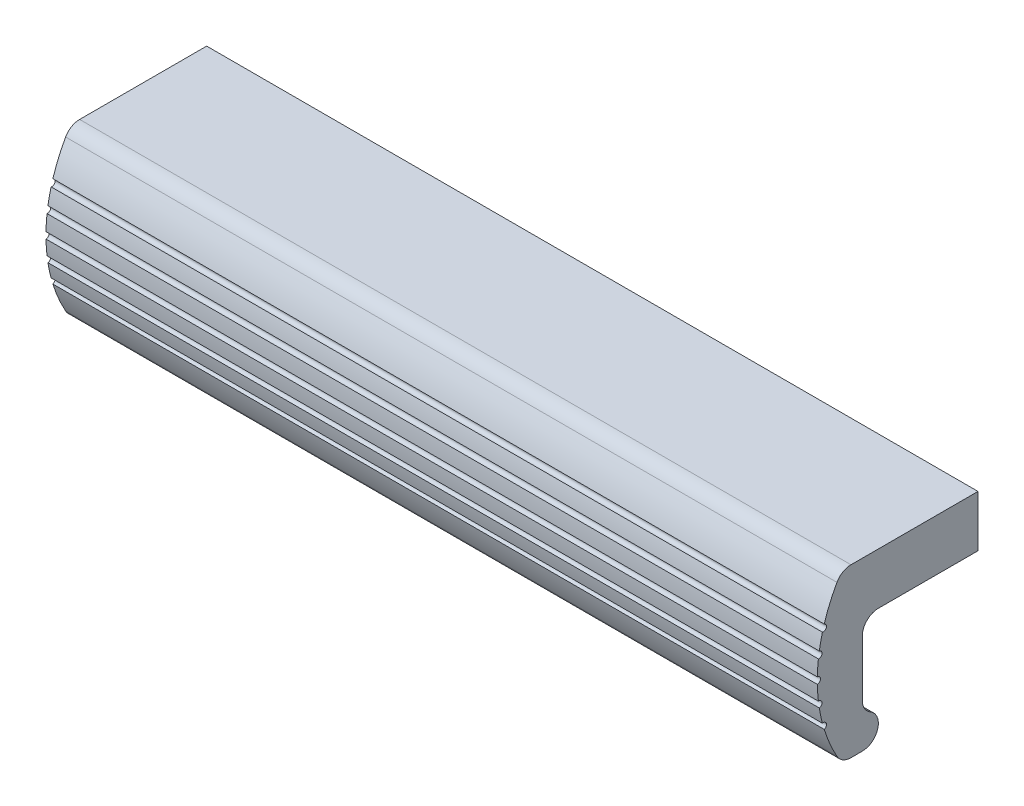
ISO-10303-21;
HEADER;
FILE_DESCRIPTION(('STEP AP214'),'2;1');
FILE_NAME('part.step','',(''),(''),'','','');
FILE_SCHEMA(('AUTOMOTIVE_DESIGN { 1 0 10303 214 1 1 1 1 }'));
ENDSEC;
DATA;
#1=APPLICATION_CONTEXT('core data for automotive mechanical design processes');
#2=APPLICATION_PROTOCOL_DEFINITION('international standard','automotive_design',2000,#1);
#3=PRODUCT_CONTEXT('',#1,'mechanical');
#4=PRODUCT('Part','Part','',(#3));
#5=PRODUCT_RELATED_PRODUCT_CATEGORY('part','',(#4));
#6=PRODUCT_DEFINITION_FORMATION('','',#4);
#7=PRODUCT_DEFINITION_CONTEXT('part definition',#1,'design');
#8=PRODUCT_DEFINITION('design','',#6,#7);
#9=PRODUCT_DEFINITION_SHAPE('','',#8);
#10=(LENGTH_UNIT() NAMED_UNIT(*) SI_UNIT(.MILLI.,.METRE.));
#11=(NAMED_UNIT(*) PLANE_ANGLE_UNIT() SI_UNIT($,.RADIAN.));
#12=(NAMED_UNIT(*) SI_UNIT($,.STERADIAN.) SOLID_ANGLE_UNIT());
#13=UNCERTAINTY_MEASURE_WITH_UNIT(LENGTH_MEASURE(1.E-05),#10,'distance_accuracy_value','');
#14=(GEOMETRIC_REPRESENTATION_CONTEXT(3) GLOBAL_UNCERTAINTY_ASSIGNED_CONTEXT((#13)) GLOBAL_UNIT_ASSIGNED_CONTEXT((#10,
#11,#12)) REPRESENTATION_CONTEXT('',''));
#15=CARTESIAN_POINT('',(0.,0.,0.));
#16=DIRECTION('',(0.,0.,1.));
#17=DIRECTION('',(1.,0.,0.));
#18=AXIS2_PLACEMENT_3D('',#15,#16,#17);
#19=CARTESIAN_POINT('',(-7.5,-4.,0.));
#20=DIRECTION('',(0.,1.,0.));
#21=DIRECTION('',(-1.,0.,0.));
#22=AXIS2_PLACEMENT_3D('',#19,#20,#21);
#23=PLANE('',#22);
#24=DIRECTION('',(1.,0.,0.));
#25=VECTOR('',#24,1.);
#26=CARTESIAN_POINT('',(-7.5,-4.,15.5));
#27=LINE('',#26,#25);
#28=CARTESIAN_POINT('',(-7.5,-4.,15.5));
#29=VERTEX_POINT('',#28);
#30=CARTESIAN_POINT('',(112.5,-4.,15.5));
#31=VERTEX_POINT('',#30);
#32=EDGE_CURVE('E9',#29,#31,#27,.T.);
#33=ORIENTED_EDGE('',*,*,#32,.F.);
#34=DIRECTION('',(0.,0.,1.));
#35=VECTOR('',#34,1.);
#36=CARTESIAN_POINT('',(-7.5,-4.,0.));
#37=LINE('',#36,#35);
#38=CARTESIAN_POINT('',(-7.5,-4.,0.));
#39=VERTEX_POINT('',#38);
#40=EDGE_CURVE('E232',#39,#29,#37,.T.);
#41=ORIENTED_EDGE('',*,*,#40,.F.);
#42=DIRECTION('',(1.,0.,0.));
#43=VECTOR('',#42,1.);
#44=CARTESIAN_POINT('',(-7.5,-4.,0.));
#45=LINE('',#44,#43);
#46=CARTESIAN_POINT('',(112.5,-4.,0.));
#47=VERTEX_POINT('',#46);
#48=EDGE_CURVE('E29',#39,#47,#45,.T.);
#49=ORIENTED_EDGE('',*,*,#48,.T.);
#50=DIRECTION('',(0.,0.,1.));
#51=VECTOR('',#50,1.);
#52=CARTESIAN_POINT('',(112.5,-4.,0.));
#53=LINE('',#52,#51);
#54=EDGE_CURVE('E167',#47,#31,#53,.T.);
#55=ORIENTED_EDGE('',*,*,#54,.T.);
#56=EDGE_LOOP('',(#33,#41,#49,#55));
#57=FACE_BOUND('',#56,.T.);
#58=ADVANCED_FACE('F14',(#57),#23,.F.);
#59=CARTESIAN_POINT('',(-7.5,-6.5,15.5));
#60=DIRECTION('',(1.,0.,0.));
#61=DIRECTION('',(0.,0.,-1.));
#62=AXIS2_PLACEMENT_3D('',#59,#60,#61);
#63=CYLINDRICAL_SURFACE('',#62,2.5);
#64=DIRECTION('',(1.,0.,0.));
#65=VECTOR('',#64,1.);
#66=CARTESIAN_POINT('',(-7.5,-6.5,18.));
#67=LINE('',#66,#65);
#68=CARTESIAN_POINT('',(-7.5,-6.5,18.));
#69=VERTEX_POINT('',#68);
#70=CARTESIAN_POINT('',(112.5,-6.5,18.));
#71=VERTEX_POINT('',#70);
#72=EDGE_CURVE('E22',#69,#71,#67,.T.);
#73=ORIENTED_EDGE('',*,*,#72,.F.);
#74=CARTESIAN_POINT('',(-7.5,-6.5,15.5));
#75=DIRECTION('',(-1.,0.,0.));
#76=DIRECTION('',(0.,0.,1.));
#77=AXIS2_PLACEMENT_3D('',#74,#75,#76);
#78=CIRCLE('',#77,2.5);
#79=EDGE_CURVE('E163',#69,#29,#78,.T.);
#80=ORIENTED_EDGE('',*,*,#79,.T.);
#81=ORIENTED_EDGE('',*,*,#32,.T.);
#82=CARTESIAN_POINT('',(112.5,-6.5,15.5));
#83=DIRECTION('',(-1.,0.,0.));
#84=DIRECTION('',(0.,0.,1.));
#85=AXIS2_PLACEMENT_3D('',#82,#83,#84);
#86=CIRCLE('',#85,2.5);
#87=EDGE_CURVE('E160',#71,#31,#86,.T.);
#88=ORIENTED_EDGE('',*,*,#87,.F.);
#89=EDGE_LOOP('',(#73,#80,#81,#88));
#90=FACE_BOUND('',#89,.T.);
#91=ADVANCED_FACE('F16',(#90),#63,.F.);
#92=CARTESIAN_POINT('',(-7.5,-6.5,18.));
#93=DIRECTION('',(0.,0.,1.));
#94=DIRECTION('',(1.,0.,0.));
#95=AXIS2_PLACEMENT_3D('',#92,#93,#94);
#96=PLANE('',#95);
#97=DIRECTION('',(1.,0.,0.));
#98=VECTOR('',#97,1.);
#99=CARTESIAN_POINT('',(-7.5,-15.1698729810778,18.));
#100=LINE('',#99,#98);
#101=CARTESIAN_POINT('',(-7.5,-15.1698729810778,18.));
#102=VERTEX_POINT('',#101);
#103=CARTESIAN_POINT('',(112.5,-15.1698729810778,18.));
#104=VERTEX_POINT('',#103);
#105=EDGE_CURVE('E324',#102,#104,#100,.T.);
#106=ORIENTED_EDGE('',*,*,#105,.F.);
#107=DIRECTION('',(0.,-1.,0.));
#108=VECTOR('',#107,1.);
#109=CARTESIAN_POINT('',(-7.5,-6.5,18.));
#110=LINE('',#109,#108);
#111=EDGE_CURVE('E235',#69,#102,#110,.T.);
#112=ORIENTED_EDGE('',*,*,#111,.F.);
#113=ORIENTED_EDGE('',*,*,#72,.T.);
#114=DIRECTION('',(0.,-1.,0.));
#115=VECTOR('',#114,1.);
#116=CARTESIAN_POINT('',(112.5,-6.5,18.));
#117=LINE('',#116,#115);
#118=EDGE_CURVE('E175',#71,#104,#117,.T.);
#119=ORIENTED_EDGE('',*,*,#118,.T.);
#120=EDGE_LOOP('',(#106,#112,#113,#119));
#121=FACE_BOUND('',#120,.T.);
#122=ADVANCED_FACE('F327',(#121),#96,.F.);
#123=CARTESIAN_POINT('',(-7.5,-15.1698729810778,15.5));
#124=DIRECTION('',(1.,0.,0.));
#125=DIRECTION('',(0.,0.,-1.));
#126=AXIS2_PLACEMENT_3D('',#123,#124,#125);
#127=CYLINDRICAL_SURFACE('',#126,2.5);
#128=DIRECTION('',(1.,0.,0.));
#129=VECTOR('',#128,1.);
#130=CARTESIAN_POINT('',(-7.5,-17.334936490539,16.75));
#131=LINE('',#130,#129);
#132=CARTESIAN_POINT('',(-7.5,-17.334936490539,16.75));
#133=VERTEX_POINT('',#132);
#134=CARTESIAN_POINT('',(112.5,-17.334936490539,16.75));
#135=VERTEX_POINT('',#134);
#136=EDGE_CURVE('E322',#133,#135,#131,.T.);
#137=ORIENTED_EDGE('',*,*,#136,.F.);
#138=CARTESIAN_POINT('',(-7.5,-15.1698729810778,15.5));
#139=DIRECTION('',(-1.,0.,0.));
#140=DIRECTION('',(0.,0.,1.));
#141=AXIS2_PLACEMENT_3D('',#138,#139,#140);
#142=CIRCLE('',#141,2.5);
#143=EDGE_CURVE('E238',#133,#102,#142,.T.);
#144=ORIENTED_EDGE('',*,*,#143,.T.);
#145=ORIENTED_EDGE('',*,*,#105,.T.);
#146=CARTESIAN_POINT('',(112.5,-15.1698729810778,15.5));
#147=DIRECTION('',(-1.,0.,0.));
#148=DIRECTION('',(0.,0.,1.));
#149=AXIS2_PLACEMENT_3D('',#146,#147,#148);
#150=CIRCLE('',#149,2.5);
#151=EDGE_CURVE('E177',#135,#104,#150,.T.);
#152=ORIENTED_EDGE('',*,*,#151,.F.);
#153=EDGE_LOOP('',(#137,#144,#145,#152));
#154=FACE_BOUND('',#153,.T.);
#155=ADVANCED_FACE('F396',(#154),#127,.F.);
#156=CARTESIAN_POINT('',(-7.5,-19.5,18.));
#157=DIRECTION('',(1.,0.,0.));
#158=DIRECTION('',(0.,0.,-1.));
#159=AXIS2_PLACEMENT_3D('',#156,#157,#158);
#160=CYLINDRICAL_SURFACE('',#159,2.5);
#161=DIRECTION('',(1.,0.,0.));
#162=VECTOR('',#161,1.);
#163=CARTESIAN_POINT('',(-7.5,-22.,18.));
#164=LINE('',#163,#162);
#165=CARTESIAN_POINT('',(-7.5,-22.,18.));
#166=VERTEX_POINT('',#165);
#167=CARTESIAN_POINT('',(112.5,-22.,18.));
#168=VERTEX_POINT('',#167);
#169=EDGE_CURVE('E320',#166,#168,#164,.T.);
#170=ORIENTED_EDGE('',*,*,#169,.F.);
#171=CARTESIAN_POINT('',(-7.5,-19.5,18.));
#172=DIRECTION('',(-1.,0.,0.));
#173=DIRECTION('',(0.,0.,1.));
#174=AXIS2_PLACEMENT_3D('',#171,#172,#173);
#175=CIRCLE('',#174,2.5);
#176=EDGE_CURVE('E241',#133,#166,#175,.T.);
#177=ORIENTED_EDGE('',*,*,#176,.F.);
#178=ORIENTED_EDGE('',*,*,#136,.T.);
#179=CARTESIAN_POINT('',(112.5,-19.5,18.));
#180=DIRECTION('',(-1.,0.,0.));
#181=DIRECTION('',(0.,0.,1.));
#182=AXIS2_PLACEMENT_3D('',#179,#180,#181);
#183=CIRCLE('',#182,2.5);
#184=EDGE_CURVE('E182',#135,#168,#183,.T.);
#185=ORIENTED_EDGE('',*,*,#184,.T.);
#186=EDGE_LOOP('',(#170,#177,#178,#185));
#187=FACE_BOUND('',#186,.T.);
#188=ADVANCED_FACE('F393',(#187),#160,.T.);
#189=CARTESIAN_POINT('',(-7.5,-22.,18.));
#190=DIRECTION('',(0.,1.,0.));
#191=DIRECTION('',(-1.,0.,0.));
#192=AXIS2_PLACEMENT_3D('',#189,#190,#191);
#193=PLANE('',#192);
#194=DIRECTION('',(1.,0.,0.));
#195=VECTOR('',#194,1.);
#196=CARTESIAN_POINT('',(-7.5,-22.,19.7616630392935));
#197=LINE('',#196,#195);
#198=CARTESIAN_POINT('',(-7.5,-22.,19.7616630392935));
#199=VERTEX_POINT('',#198);
#200=CARTESIAN_POINT('',(112.5,-22.,19.7616630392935));
#201=VERTEX_POINT('',#200);
#202=EDGE_CURVE('E318',#199,#201,#197,.T.);
#203=ORIENTED_EDGE('',*,*,#202,.F.);
#204=DIRECTION('',(0.,0.,1.));
#205=VECTOR('',#204,1.);
#206=CARTESIAN_POINT('',(-7.5,-22.,18.));
#207=LINE('',#206,#205);
#208=EDGE_CURVE('E244',#166,#199,#207,.T.);
#209=ORIENTED_EDGE('',*,*,#208,.F.);
#210=ORIENTED_EDGE('',*,*,#169,.T.);
#211=DIRECTION('',(0.,0.,1.));
#212=VECTOR('',#211,1.);
#213=CARTESIAN_POINT('',(112.5,-22.,18.));
#214=LINE('',#213,#212);
#215=EDGE_CURVE('E185',#168,#201,#214,.T.);
#216=ORIENTED_EDGE('',*,*,#215,.T.);
#217=EDGE_LOOP('',(#203,#209,#210,#216));
#218=FACE_BOUND('',#217,.T.);
#219=ADVANCED_FACE('F390',(#218),#193,.F.);
#220=CARTESIAN_POINT('',(-7.5,-19.5,19.7616630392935));
#221=DIRECTION('',(1.,0.,0.));
#222=DIRECTION('',(0.,0.,-1.));
#223=AXIS2_PLACEMENT_3D('',#220,#221,#222);
#224=CYLINDRICAL_SURFACE('',#223,2.5);
#225=DIRECTION('',(1.,0.,0.));
#226=VECTOR('',#225,1.);
#227=CARTESIAN_POINT('',(-7.5,-20.720930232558,21.943251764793));
#228=LINE('',#227,#226);
#229=CARTESIAN_POINT('',(-7.5,-20.720930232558,21.943251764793));
#230=VERTEX_POINT('',#229);
#231=CARTESIAN_POINT('',(112.5,-20.720930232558,21.943251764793));
#232=VERTEX_POINT('',#231);
#233=EDGE_CURVE('E316',#230,#232,#228,.T.);
#234=ORIENTED_EDGE('',*,*,#233,.F.);
#235=CARTESIAN_POINT('',(-7.5,-19.5,19.7616630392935));
#236=DIRECTION('',(-1.,0.,0.));
#237=DIRECTION('',(0.,0.,1.));
#238=AXIS2_PLACEMENT_3D('',#235,#236,#237);
#239=CIRCLE('',#238,2.5);
#240=EDGE_CURVE('E247',#199,#230,#239,.T.);
#241=ORIENTED_EDGE('',*,*,#240,.F.);
#242=ORIENTED_EDGE('',*,*,#202,.T.);
#243=CARTESIAN_POINT('',(112.5,-19.5,19.7616630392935));
#244=DIRECTION('',(-1.,0.,0.));
#245=DIRECTION('',(0.,0.,1.));
#246=AXIS2_PLACEMENT_3D('',#243,#244,#245);
#247=CIRCLE('',#246,2.5);
#248=EDGE_CURVE('E188',#201,#232,#247,.T.);
#249=ORIENTED_EDGE('',*,*,#248,.T.);
#250=EDGE_LOOP('',(#234,#241,#242,#249));
#251=FACE_BOUND('',#250,.T.);
#252=ADVANCED_FACE('F386',(#251),#224,.T.);
#253=CARTESIAN_POINT('',(-7.5,-9.,1.));
#254=DIRECTION('',(1.,0.,0.));
#255=DIRECTION('',(0.,0.,-1.));
#256=AXIS2_PLACEMENT_3D('',#253,#254,#255);
#257=CYLINDRICAL_SURFACE('',#256,24.);
#258=DIRECTION('',(1.,0.,0.));
#259=VECTOR('',#258,1.);
#260=CARTESIAN_POINT('',(-7.5,-16.094465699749,23.9274629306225));
#261=LINE('',#260,#259);
#262=CARTESIAN_POINT('',(-7.5,-16.094465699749,23.9274629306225));
#263=VERTEX_POINT('',#262);
#264=CARTESIAN_POINT('',(112.5,-16.094465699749,23.9274629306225));
#265=VERTEX_POINT('',#264);
#266=EDGE_CURVE('E314',#263,#265,#261,.T.);
#267=ORIENTED_EDGE('',*,*,#266,.F.);
#268=CARTESIAN_POINT('',(-7.5,-9.,1.));
#269=DIRECTION('',(-1.,0.,0.));
#270=DIRECTION('',(0.,0.,1.));
#271=AXIS2_PLACEMENT_3D('',#268,#269,#270);
#272=CIRCLE('',#271,24.);
#273=EDGE_CURVE('E250',#230,#263,#272,.T.);
#274=ORIENTED_EDGE('',*,*,#273,.F.);
#275=ORIENTED_EDGE('',*,*,#233,.T.);
#276=CARTESIAN_POINT('',(112.5,-9.,1.));
#277=DIRECTION('',(-1.,0.,0.));
#278=DIRECTION('',(0.,0.,1.));
#279=AXIS2_PLACEMENT_3D('',#276,#277,#278);
#280=CIRCLE('',#279,24.);
#281=EDGE_CURVE('E191',#232,#265,#280,.T.);
#282=ORIENTED_EDGE('',*,*,#281,.T.);
#283=EDGE_LOOP('',(#267,#274,#275,#282));
#284=FACE_BOUND('',#283,.T.);
#285=ADVANCED_FACE('F381',(#284),#257,.T.);
#286=CARTESIAN_POINT('',(-7.5,-15.615296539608,24.0702807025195));
#287=DIRECTION('',(1.,0.,0.));
#288=DIRECTION('',(0.,0.,-1.));
#289=AXIS2_PLACEMENT_3D('',#286,#287,#288);
#290=CYLINDRICAL_SURFACE('',#289,0.5);
#291=DIRECTION('',(1.,0.,0.));
#292=VECTOR('',#291,1.);
#293=CARTESIAN_POINT('',(-7.5,-15.1332561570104,24.2030853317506));
#294=LINE('',#293,#292);
#295=CARTESIAN_POINT('',(-7.5,-15.1332561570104,24.2030853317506));
#296=VERTEX_POINT('',#295);
#297=CARTESIAN_POINT('',(112.5,-15.1332561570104,24.2030853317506));
#298=VERTEX_POINT('',#297);
#299=EDGE_CURVE('E312',#296,#298,#294,.T.);
#300=ORIENTED_EDGE('',*,*,#299,.F.);
#301=CARTESIAN_POINT('',(-7.5,-15.615296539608,24.0702807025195));
#302=DIRECTION('',(-1.,0.,0.));
#303=DIRECTION('',(0.,0.,1.));
#304=AXIS2_PLACEMENT_3D('',#301,#302,#303);
#305=CIRCLE('',#304,0.5);
#306=EDGE_CURVE('E253',#296,#263,#305,.T.);
#307=ORIENTED_EDGE('',*,*,#306,.T.);
#308=ORIENTED_EDGE('',*,*,#266,.T.);
#309=CARTESIAN_POINT('',(112.5,-15.615296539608,24.0702807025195));
#310=DIRECTION('',(-1.,0.,0.));
#311=DIRECTION('',(0.,0.,1.));
#312=AXIS2_PLACEMENT_3D('',#309,#310,#311);
#313=CIRCLE('',#312,0.5);
#314=EDGE_CURVE('E194',#298,#265,#313,.T.);
#315=ORIENTED_EDGE('',*,*,#314,.F.);
#316=EDGE_LOOP('',(#300,#307,#308,#315));
#317=FACE_BOUND('',#316,.T.);
#318=ADVANCED_FACE('F378',(#317),#290,.F.);
#319=CARTESIAN_POINT('',(-7.5,-9.,1.));
#320=DIRECTION('',(1.,0.,0.));
#321=DIRECTION('',(0.,0.,-1.));
#322=AXIS2_PLACEMENT_3D('',#319,#320,#321);
#323=CYLINDRICAL_SURFACE('',#322,24.);
#324=DIRECTION('',(1.,0.,0.));
#325=VECTOR('',#324,1.);
#326=CARTESIAN_POINT('',(-7.5,-12.8345367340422,24.6916932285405));
#327=LINE('',#326,#325);
#328=CARTESIAN_POINT('',(-7.5,-12.8345367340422,24.6916932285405));
#329=VERTEX_POINT('',#328);
#330=CARTESIAN_POINT('',(112.5,-12.8345367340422,24.6916932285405));
#331=VERTEX_POINT('',#330);
#332=EDGE_CURVE('E310',#329,#331,#327,.T.);
#333=ORIENTED_EDGE('',*,*,#332,.F.);
#334=CARTESIAN_POINT('',(-7.5,-9.,1.));
#335=DIRECTION('',(-1.,0.,0.));
#336=DIRECTION('',(0.,0.,1.));
#337=AXIS2_PLACEMENT_3D('',#334,#335,#336);
#338=CIRCLE('',#337,24.);
#339=EDGE_CURVE('E256',#296,#329,#338,.T.);
#340=ORIENTED_EDGE('',*,*,#339,.F.);
#341=ORIENTED_EDGE('',*,*,#299,.T.);
#342=CARTESIAN_POINT('',(112.5,-9.,1.));
#343=DIRECTION('',(-1.,0.,0.));
#344=DIRECTION('',(0.,0.,1.));
#345=AXIS2_PLACEMENT_3D('',#342,#343,#344);
#346=CIRCLE('',#345,24.);
#347=EDGE_CURVE('E197',#298,#331,#346,.T.);
#348=ORIENTED_EDGE('',*,*,#347,.T.);
#349=EDGE_LOOP('',(#333,#340,#341,#348));
#350=FACE_BOUND('',#349,.T.);
#351=ADVANCED_FACE('F374',(#350),#323,.T.);
#352=CARTESIAN_POINT('',(-7.5,-12.3401544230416,24.7664336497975));
#353=DIRECTION('',(1.,0.,0.));
#354=DIRECTION('',(0.,0.,-1.));
#355=AXIS2_PLACEMENT_3D('',#352,#353,#354);
#356=CYLINDRICAL_SURFACE('',#355,0.5);
#357=DIRECTION('',(1.,0.,0.));
#358=VECTOR('',#357,1.);
#359=CARTESIAN_POINT('',(-7.5,-11.8443223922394,24.830858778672));
#360=LINE('',#359,#358);
#361=CARTESIAN_POINT('',(-7.5,-11.8443223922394,24.830858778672));
#362=VERTEX_POINT('',#361);
#363=CARTESIAN_POINT('',(112.5,-11.8443223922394,24.830858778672));
#364=VERTEX_POINT('',#363);
#365=EDGE_CURVE('E308',#362,#364,#360,.T.);
#366=ORIENTED_EDGE('',*,*,#365,.F.);
#367=CARTESIAN_POINT('',(-7.5,-12.3401544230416,24.7664336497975));
#368=DIRECTION('',(-1.,0.,0.));
#369=DIRECTION('',(0.,0.,1.));
#370=AXIS2_PLACEMENT_3D('',#367,#368,#369);
#371=CIRCLE('',#370,0.5);
#372=EDGE_CURVE('E259',#362,#329,#371,.T.);
#373=ORIENTED_EDGE('',*,*,#372,.T.);
#374=ORIENTED_EDGE('',*,*,#332,.T.);
#375=CARTESIAN_POINT('',(112.5,-12.3401544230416,24.7664336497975));
#376=DIRECTION('',(-1.,0.,0.));
#377=DIRECTION('',(0.,0.,1.));
#378=AXIS2_PLACEMENT_3D('',#375,#376,#377);
#379=CIRCLE('',#378,0.5);
#380=EDGE_CURVE('E200',#364,#331,#379,.T.);
#381=ORIENTED_EDGE('',*,*,#380,.F.);
#382=EDGE_LOOP('',(#366,#373,#374,#381));
#383=FACE_BOUND('',#382,.T.);
#384=ADVANCED_FACE('F369',(#383),#356,.F.);
#385=CARTESIAN_POINT('',(-7.5,-9.,1.));
#386=DIRECTION('',(1.,0.,0.));
#387=DIRECTION('',(0.,0.,-1.));
#388=AXIS2_PLACEMENT_3D('',#385,#386,#387);
#389=CYLINDRICAL_SURFACE('',#388,24.);
#390=DIRECTION('',(1.,0.,0.));
#391=VECTOR('',#390,1.);
#392=CARTESIAN_POINT('',(-7.5,-9.49997287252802,24.9947916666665));
#393=LINE('',#392,#391);
#394=CARTESIAN_POINT('',(-7.5,-9.49997287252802,24.9947916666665));
#395=VERTEX_POINT('',#394);
#396=CARTESIAN_POINT('',(112.5,-9.49997287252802,24.9947916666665));
#397=VERTEX_POINT('',#396);
#398=EDGE_CURVE('E306',#395,#397,#393,.T.);
#399=ORIENTED_EDGE('',*,*,#398,.F.);
#400=CARTESIAN_POINT('',(-7.5,-9.,1.));
#401=DIRECTION('',(-1.,0.,0.));
#402=DIRECTION('',(0.,0.,1.));
#403=AXIS2_PLACEMENT_3D('',#400,#401,#402);
#404=CIRCLE('',#403,24.);
#405=EDGE_CURVE('E262',#362,#395,#404,.T.);
#406=ORIENTED_EDGE('',*,*,#405,.F.);
#407=ORIENTED_EDGE('',*,*,#365,.T.);
#408=CARTESIAN_POINT('',(112.5,-9.,1.));
#409=DIRECTION('',(-1.,0.,0.));
#410=DIRECTION('',(0.,0.,1.));
#411=AXIS2_PLACEMENT_3D('',#408,#409,#410);
#412=CIRCLE('',#411,24.);
#413=EDGE_CURVE('E203',#364,#397,#412,.T.);
#414=ORIENTED_EDGE('',*,*,#413,.T.);
#415=EDGE_LOOP('',(#399,#406,#407,#414));
#416=FACE_BOUND('',#415,.T.);
#417=ADVANCED_FACE('F365',(#416),#389,.T.);
#418=CARTESIAN_POINT('',(-7.5,-9.,25.));
#419=DIRECTION('',(1.,0.,0.));
#420=DIRECTION('',(0.,0.,-1.));
#421=AXIS2_PLACEMENT_3D('',#418,#419,#420);
#422=CYLINDRICAL_SURFACE('',#421,0.500000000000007);
#423=DIRECTION('',(1.,0.,0.));
#424=VECTOR('',#423,1.);
#425=CARTESIAN_POINT('',(-7.5,-8.50002712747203,24.9947916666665));
#426=LINE('',#425,#424);
#427=CARTESIAN_POINT('',(-7.5,-8.50002712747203,24.9947916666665));
#428=VERTEX_POINT('',#427);
#429=CARTESIAN_POINT('',(112.5,-8.50002712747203,24.9947916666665));
#430=VERTEX_POINT('',#429);
#431=EDGE_CURVE('E304',#428,#430,#426,.T.);
#432=ORIENTED_EDGE('',*,*,#431,.F.);
#433=CARTESIAN_POINT('',(-7.5,-9.,25.));
#434=DIRECTION('',(-1.,0.,0.));
#435=DIRECTION('',(0.,0.,1.));
#436=AXIS2_PLACEMENT_3D('',#433,#434,#435);
#437=CIRCLE('',#436,0.500000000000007);
#438=EDGE_CURVE('E265',#428,#395,#437,.T.);
#439=ORIENTED_EDGE('',*,*,#438,.T.);
#440=ORIENTED_EDGE('',*,*,#398,.T.);
#441=CARTESIAN_POINT('',(112.5,-9.,25.));
#442=DIRECTION('',(-1.,0.,0.));
#443=DIRECTION('',(0.,0.,1.));
#444=AXIS2_PLACEMENT_3D('',#441,#442,#443);
#445=CIRCLE('',#444,0.500000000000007);
#446=EDGE_CURVE('E206',#430,#397,#445,.T.);
#447=ORIENTED_EDGE('',*,*,#446,.F.);
#448=EDGE_LOOP('',(#432,#439,#440,#447));
#449=FACE_BOUND('',#448,.T.);
#450=ADVANCED_FACE('F361',(#449),#422,.F.);
#451=CARTESIAN_POINT('',(-7.5,-9.,1.));
#452=DIRECTION('',(1.,0.,0.));
#453=DIRECTION('',(0.,0.,-1.));
#454=AXIS2_PLACEMENT_3D('',#451,#452,#453);
#455=CYLINDRICAL_SURFACE('',#454,24.);
#456=DIRECTION('',(1.,0.,0.));
#457=VECTOR('',#456,1.);
#458=CARTESIAN_POINT('',(-7.5,-6.15567760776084,24.830858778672));
#459=LINE('',#458,#457);
#460=CARTESIAN_POINT('',(-7.5,-6.15567760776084,24.830858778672));
#461=VERTEX_POINT('',#460);
#462=CARTESIAN_POINT('',(112.5,-6.15567760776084,24.830858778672));
#463=VERTEX_POINT('',#462);
#464=EDGE_CURVE('E302',#461,#463,#459,.T.);
#465=ORIENTED_EDGE('',*,*,#464,.F.);
#466=CARTESIAN_POINT('',(-7.5,-9.,1.));
#467=DIRECTION('',(-1.,0.,0.));
#468=DIRECTION('',(0.,0.,1.));
#469=AXIS2_PLACEMENT_3D('',#466,#467,#468);
#470=CIRCLE('',#469,24.);
#471=EDGE_CURVE('E268',#428,#461,#470,.T.);
#472=ORIENTED_EDGE('',*,*,#471,.F.);
#473=ORIENTED_EDGE('',*,*,#431,.T.);
#474=CARTESIAN_POINT('',(112.5,-9.,1.));
#475=DIRECTION('',(-1.,0.,0.));
#476=DIRECTION('',(0.,0.,1.));
#477=AXIS2_PLACEMENT_3D('',#474,#475,#476);
#478=CIRCLE('',#477,24.);
#479=EDGE_CURVE('E209',#430,#463,#478,.T.);
#480=ORIENTED_EDGE('',*,*,#479,.T.);
#481=EDGE_LOOP('',(#465,#472,#473,#480));
#482=FACE_BOUND('',#481,.T.);
#483=ADVANCED_FACE('F357',(#482),#455,.T.);
#484=CARTESIAN_POINT('',(-7.5,-5.65984557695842,24.7664336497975));
#485=DIRECTION('',(1.,0.,0.));
#486=DIRECTION('',(0.,0.,-1.));
#487=AXIS2_PLACEMENT_3D('',#484,#485,#486);
#488=CYLINDRICAL_SURFACE('',#487,0.499999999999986);
#489=DIRECTION('',(1.,0.,0.));
#490=VECTOR('',#489,1.);
#491=CARTESIAN_POINT('',(-7.5,-5.16546326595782,24.6916932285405));
#492=LINE('',#491,#490);
#493=CARTESIAN_POINT('',(-7.5,-5.16546326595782,24.6916932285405));
#494=VERTEX_POINT('',#493);
#495=CARTESIAN_POINT('',(112.5,-5.16546326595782,24.6916932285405));
#496=VERTEX_POINT('',#495);
#497=EDGE_CURVE('E300',#494,#496,#492,.T.);
#498=ORIENTED_EDGE('',*,*,#497,.F.);
#499=CARTESIAN_POINT('',(-7.5,-5.65984557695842,24.7664336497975));
#500=DIRECTION('',(-1.,0.,0.));
#501=DIRECTION('',(0.,0.,1.));
#502=AXIS2_PLACEMENT_3D('',#499,#500,#501);
#503=CIRCLE('',#502,0.499999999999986);
#504=EDGE_CURVE('E271',#494,#461,#503,.T.);
#505=ORIENTED_EDGE('',*,*,#504,.T.);
#506=ORIENTED_EDGE('',*,*,#464,.T.);
#507=CARTESIAN_POINT('',(112.5,-5.65984557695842,24.7664336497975));
#508=DIRECTION('',(-1.,0.,0.));
#509=DIRECTION('',(0.,0.,1.));
#510=AXIS2_PLACEMENT_3D('',#507,#508,#509);
#511=CIRCLE('',#510,0.499999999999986);
#512=EDGE_CURVE('E212',#496,#463,#511,.T.);
#513=ORIENTED_EDGE('',*,*,#512,.F.);
#514=EDGE_LOOP('',(#498,#505,#506,#513));
#515=FACE_BOUND('',#514,.T.);
#516=ADVANCED_FACE('F354',(#515),#488,.F.);
#517=CARTESIAN_POINT('',(-7.5,-9.,1.));
#518=DIRECTION('',(1.,0.,0.));
#519=DIRECTION('',(0.,0.,-1.));
#520=AXIS2_PLACEMENT_3D('',#517,#518,#519);
#521=CYLINDRICAL_SURFACE('',#520,24.);
#522=DIRECTION('',(1.,0.,0.));
#523=VECTOR('',#522,1.);
#524=CARTESIAN_POINT('',(-7.5,-2.8667438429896,24.2030853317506));
#525=LINE('',#524,#523);
#526=CARTESIAN_POINT('',(-7.5,-2.8667438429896,24.2030853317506));
#527=VERTEX_POINT('',#526);
#528=CARTESIAN_POINT('',(112.5,-2.8667438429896,24.2030853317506));
#529=VERTEX_POINT('',#528);
#530=EDGE_CURVE('E298',#527,#529,#525,.T.);
#531=ORIENTED_EDGE('',*,*,#530,.F.);
#532=CARTESIAN_POINT('',(-7.5,-9.,1.));
#533=DIRECTION('',(-1.,0.,0.));
#534=DIRECTION('',(0.,0.,1.));
#535=AXIS2_PLACEMENT_3D('',#532,#533,#534);
#536=CIRCLE('',#535,24.);
#537=EDGE_CURVE('E274',#494,#527,#536,.T.);
#538=ORIENTED_EDGE('',*,*,#537,.F.);
#539=ORIENTED_EDGE('',*,*,#497,.T.);
#540=CARTESIAN_POINT('',(112.5,-9.,1.));
#541=DIRECTION('',(-1.,0.,0.));
#542=DIRECTION('',(0.,0.,1.));
#543=AXIS2_PLACEMENT_3D('',#540,#541,#542);
#544=CIRCLE('',#543,24.);
#545=EDGE_CURVE('E215',#496,#529,#544,.T.);
#546=ORIENTED_EDGE('',*,*,#545,.T.);
#547=EDGE_LOOP('',(#531,#538,#539,#546));
#548=FACE_BOUND('',#547,.T.);
#549=ADVANCED_FACE('F350',(#548),#521,.T.);
#550=CARTESIAN_POINT('',(-7.5,-2.38470346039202,24.0702807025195));
#551=DIRECTION('',(1.,0.,0.));
#552=DIRECTION('',(0.,0.,-1.));
#553=AXIS2_PLACEMENT_3D('',#550,#551,#552);
#554=CYLINDRICAL_SURFACE('',#553,0.500000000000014);
#555=DIRECTION('',(1.,0.,0.));
#556=VECTOR('',#555,1.);
#557=CARTESIAN_POINT('',(-7.5,-1.90553430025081,23.9274629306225));
#558=LINE('',#557,#556);
#559=CARTESIAN_POINT('',(-7.5,-1.90553430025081,23.9274629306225));
#560=VERTEX_POINT('',#559);
#561=CARTESIAN_POINT('',(112.5,-1.90553430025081,23.9274629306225));
#562=VERTEX_POINT('',#561);
#563=EDGE_CURVE('E296',#560,#562,#558,.T.);
#564=ORIENTED_EDGE('',*,*,#563,.F.);
#565=CARTESIAN_POINT('',(-7.5,-2.38470346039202,24.0702807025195));
#566=DIRECTION('',(-1.,0.,0.));
#567=DIRECTION('',(0.,0.,1.));
#568=AXIS2_PLACEMENT_3D('',#565,#566,#567);
#569=CIRCLE('',#568,0.500000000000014);
#570=EDGE_CURVE('E277',#560,#527,#569,.T.);
#571=ORIENTED_EDGE('',*,*,#570,.T.);
#572=ORIENTED_EDGE('',*,*,#530,.T.);
#573=CARTESIAN_POINT('',(112.5,-2.38470346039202,24.0702807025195));
#574=DIRECTION('',(-1.,0.,0.));
#575=DIRECTION('',(0.,0.,1.));
#576=AXIS2_PLACEMENT_3D('',#573,#574,#575);
#577=CIRCLE('',#576,0.500000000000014);
#578=EDGE_CURVE('E218',#562,#529,#577,.T.);
#579=ORIENTED_EDGE('',*,*,#578,.F.);
#580=EDGE_LOOP('',(#564,#571,#572,#579));
#581=FACE_BOUND('',#580,.T.);
#582=ADVANCED_FACE('F345',(#581),#554,.F.);
#583=CARTESIAN_POINT('',(-7.5,-9.,1.));
#584=DIRECTION('',(1.,0.,0.));
#585=DIRECTION('',(0.,0.,-1.));
#586=AXIS2_PLACEMENT_3D('',#583,#584,#585);
#587=CYLINDRICAL_SURFACE('',#586,24.);
#588=DIRECTION('',(1.,0.,0.));
#589=VECTOR('',#588,1.);
#590=CARTESIAN_POINT('',(-7.5,2.72093023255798,21.943251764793));
#591=LINE('',#590,#589);
#592=CARTESIAN_POINT('',(-7.5,2.72093023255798,21.943251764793));
#593=VERTEX_POINT('',#592);
#594=CARTESIAN_POINT('',(112.5,2.72093023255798,21.943251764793));
#595=VERTEX_POINT('',#594);
#596=EDGE_CURVE('E294',#593,#595,#591,.T.);
#597=ORIENTED_EDGE('',*,*,#596,.F.);
#598=CARTESIAN_POINT('',(-7.5,-9.,1.));
#599=DIRECTION('',(-1.,0.,0.));
#600=DIRECTION('',(0.,0.,1.));
#601=AXIS2_PLACEMENT_3D('',#598,#599,#600);
#602=CIRCLE('',#601,24.);
#603=EDGE_CURVE('E280',#560,#593,#602,.T.);
#604=ORIENTED_EDGE('',*,*,#603,.F.);
#605=ORIENTED_EDGE('',*,*,#563,.T.);
#606=CARTESIAN_POINT('',(112.5,-9.,1.));
#607=DIRECTION('',(-1.,0.,0.));
#608=DIRECTION('',(0.,0.,1.));
#609=AXIS2_PLACEMENT_3D('',#606,#607,#608);
#610=CIRCLE('',#609,24.);
#611=EDGE_CURVE('E221',#562,#595,#610,.T.);
#612=ORIENTED_EDGE('',*,*,#611,.T.);
#613=EDGE_LOOP('',(#597,#604,#605,#612));
#614=FACE_BOUND('',#613,.T.);
#615=ADVANCED_FACE('F341',(#614),#587,.T.);
#616=CARTESIAN_POINT('',(-7.5,1.5,19.7616630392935));
#617=DIRECTION('',(1.,0.,0.));
#618=DIRECTION('',(0.,0.,-1.));
#619=AXIS2_PLACEMENT_3D('',#616,#617,#618);
#620=CYLINDRICAL_SURFACE('',#619,2.5);
#621=DIRECTION('',(1.,0.,0.));
#622=VECTOR('',#621,1.);
#623=CARTESIAN_POINT('',(-7.5,4.,19.7616630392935));
#624=LINE('',#623,#622);
#625=CARTESIAN_POINT('',(-7.5,4.,19.7616630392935));
#626=VERTEX_POINT('',#625);
#627=CARTESIAN_POINT('',(112.5,4.,19.7616630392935));
#628=VERTEX_POINT('',#627);
#629=EDGE_CURVE('E292',#626,#628,#624,.T.);
#630=ORIENTED_EDGE('',*,*,#629,.F.);
#631=CARTESIAN_POINT('',(-7.5,1.5,19.7616630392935));
#632=DIRECTION('',(-1.,0.,0.));
#633=DIRECTION('',(0.,0.,1.));
#634=AXIS2_PLACEMENT_3D('',#631,#632,#633);
#635=CIRCLE('',#634,2.5);
#636=EDGE_CURVE('E283',#593,#626,#635,.T.);
#637=ORIENTED_EDGE('',*,*,#636,.F.);
#638=ORIENTED_EDGE('',*,*,#596,.T.);
#639=CARTESIAN_POINT('',(112.5,1.5,19.7616630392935));
#640=DIRECTION('',(-1.,0.,0.));
#641=DIRECTION('',(0.,0.,1.));
#642=AXIS2_PLACEMENT_3D('',#639,#640,#641);
#643=CIRCLE('',#642,2.5);
#644=EDGE_CURVE('E224',#595,#628,#643,.T.);
#645=ORIENTED_EDGE('',*,*,#644,.T.);
#646=EDGE_LOOP('',(#630,#637,#638,#645));
#647=FACE_BOUND('',#646,.T.);
#648=ADVANCED_FACE('F337',(#647),#620,.T.);
#649=CARTESIAN_POINT('',(-7.5,4.,0.));
#650=DIRECTION('',(0.,1.,0.));
#651=DIRECTION('',(-1.,0.,0.));
#652=AXIS2_PLACEMENT_3D('',#649,#650,#651);
#653=PLANE('',#652);
#654=DIRECTION('',(1.,0.,0.));
#655=VECTOR('',#654,1.);
#656=CARTESIAN_POINT('',(-7.5,4.,0.));
#657=LINE('',#656,#655);
#658=CARTESIAN_POINT('',(-7.5,4.,0.));
#659=VERTEX_POINT('',#658);
#660=CARTESIAN_POINT('',(112.5,4.,0.));
#661=VERTEX_POINT('',#660);
#662=EDGE_CURVE('E37',#659,#661,#657,.T.);
#663=ORIENTED_EDGE('',*,*,#662,.F.);
#664=DIRECTION('',(0.,0.,1.));
#665=VECTOR('',#664,1.);
#666=CARTESIAN_POINT('',(-7.5,4.,0.));
#667=LINE('',#666,#665);
#668=EDGE_CURVE('E286',#659,#626,#667,.T.);
#669=ORIENTED_EDGE('',*,*,#668,.T.);
#670=ORIENTED_EDGE('',*,*,#629,.T.);
#671=DIRECTION('',(0.,0.,1.));
#672=VECTOR('',#671,1.);
#673=CARTESIAN_POINT('',(112.5,4.,0.));
#674=LINE('',#673,#672);
#675=EDGE_CURVE('E227',#661,#628,#674,.T.);
#676=ORIENTED_EDGE('',*,*,#675,.F.);
#677=EDGE_LOOP('',(#663,#669,#670,#676));
#678=FACE_BOUND('',#677,.T.);
#679=ADVANCED_FACE('F333',(#678),#653,.T.);
#680=CARTESIAN_POINT('',(-7.5,-4.,0.));
#681=DIRECTION('',(0.,0.,-1.));
#682=DIRECTION('',(-1.,0.,0.));
#683=AXIS2_PLACEMENT_3D('',#680,#681,#682);
#684=PLANE('',#683);
#685=CARTESIAN_POINT('',(0.,0.,0.));
#686=DIRECTION('',(0.,0.,-1.));
#687=DIRECTION('',(-1.,0.,0.));
#688=AXIS2_PLACEMENT_3D('',#685,#686,#687);
#689=CIRCLE('',#688,2.);
#690=CARTESIAN_POINT('',(-2.,0.,0.));
#691=VERTEX_POINT('',#690);
#692=EDGE_CURVE('E632',#691,#691,#689,.T.);
#693=ORIENTED_EDGE('',*,*,#692,.F.);
#694=EDGE_LOOP('',(#693));
#695=FACE_BOUND('',#694,.T.);
#696=CARTESIAN_POINT('',(105.,0.,0.));
#697=DIRECTION('',(0.,0.,-1.));
#698=DIRECTION('',(-1.,0.,0.));
#699=AXIS2_PLACEMENT_3D('',#696,#697,#698);
#700=CIRCLE('',#699,2.);
#701=CARTESIAN_POINT('',(103.,0.,0.));
#702=VERTEX_POINT('',#701);
#703=EDGE_CURVE('E631',#702,#702,#700,.T.);
#704=ORIENTED_EDGE('',*,*,#703,.F.);
#705=EDGE_LOOP('',(#704));
#706=FACE_BOUND('',#705,.T.);
#707=DIRECTION('',(0.,1.,0.));
#708=VECTOR('',#707,1.);
#709=CARTESIAN_POINT('',(-7.5,-4.,0.));
#710=LINE('',#709,#708);
#711=EDGE_CURVE('E288',#39,#659,#710,.T.);
#712=ORIENTED_EDGE('',*,*,#711,.T.);
#713=ORIENTED_EDGE('',*,*,#662,.T.);
#714=DIRECTION('',(0.,1.,0.));
#715=VECTOR('',#714,1.);
#716=CARTESIAN_POINT('',(112.5,-4.,0.));
#717=LINE('',#716,#715);
#718=EDGE_CURVE('E230',#47,#661,#717,.T.);
#719=ORIENTED_EDGE('',*,*,#718,.F.);
#720=ORIENTED_EDGE('',*,*,#48,.F.);
#721=EDGE_LOOP('',(#712,#713,#719,#720));
#722=FACE_BOUND('',#721,.T.);
#723=ADVANCED_FACE('F332',(#695,#706,#722),#684,.T.);
#724=CARTESIAN_POINT('',(-7.5,-6.5,15.5));
#725=DIRECTION('',(-1.,0.,0.));
#726=DIRECTION('',(0.,0.,1.));
#727=AXIS2_PLACEMENT_3D('',#724,#725,#726);
#728=PLANE('',#727);
#729=ORIENTED_EDGE('',*,*,#40,.T.);
#730=ORIENTED_EDGE('',*,*,#79,.F.);
#731=ORIENTED_EDGE('',*,*,#111,.T.);
#732=ORIENTED_EDGE('',*,*,#143,.F.);
#733=ORIENTED_EDGE('',*,*,#176,.T.);
#734=ORIENTED_EDGE('',*,*,#208,.T.);
#735=ORIENTED_EDGE('',*,*,#240,.T.);
#736=ORIENTED_EDGE('',*,*,#273,.T.);
#737=ORIENTED_EDGE('',*,*,#306,.F.);
#738=ORIENTED_EDGE('',*,*,#339,.T.);
#739=ORIENTED_EDGE('',*,*,#372,.F.);
#740=ORIENTED_EDGE('',*,*,#405,.T.);
#741=ORIENTED_EDGE('',*,*,#438,.F.);
#742=ORIENTED_EDGE('',*,*,#471,.T.);
#743=ORIENTED_EDGE('',*,*,#504,.F.);
#744=ORIENTED_EDGE('',*,*,#537,.T.);
#745=ORIENTED_EDGE('',*,*,#570,.F.);
#746=ORIENTED_EDGE('',*,*,#603,.T.);
#747=ORIENTED_EDGE('',*,*,#636,.T.);
#748=ORIENTED_EDGE('',*,*,#668,.F.);
#749=ORIENTED_EDGE('',*,*,#711,.F.);
#750=EDGE_LOOP('',(#729,#730,#731,#732,#733,#734,#735,#736,#737,#738,#739,#740,#741,#742,#743,
#744,#745,#746,#747,#748,#749));
#751=FACE_BOUND('',#750,.T.);
#752=ADVANCED_FACE('F329',(#751),#728,.T.);
#753=CARTESIAN_POINT('',(112.5,-6.5,15.5));
#754=DIRECTION('',(-1.,0.,0.));
#755=DIRECTION('',(0.,0.,1.));
#756=AXIS2_PLACEMENT_3D('',#753,#754,#755);
#757=PLANE('',#756);
#758=ORIENTED_EDGE('',*,*,#54,.F.);
#759=ORIENTED_EDGE('',*,*,#718,.T.);
#760=ORIENTED_EDGE('',*,*,#675,.T.);
#761=ORIENTED_EDGE('',*,*,#644,.F.);
#762=ORIENTED_EDGE('',*,*,#611,.F.);
#763=ORIENTED_EDGE('',*,*,#578,.T.);
#764=ORIENTED_EDGE('',*,*,#545,.F.);
#765=ORIENTED_EDGE('',*,*,#512,.T.);
#766=ORIENTED_EDGE('',*,*,#479,.F.);
#767=ORIENTED_EDGE('',*,*,#446,.T.);
#768=ORIENTED_EDGE('',*,*,#413,.F.);
#769=ORIENTED_EDGE('',*,*,#380,.T.);
#770=ORIENTED_EDGE('',*,*,#347,.F.);
#771=ORIENTED_EDGE('',*,*,#314,.T.);
#772=ORIENTED_EDGE('',*,*,#281,.F.);
#773=ORIENTED_EDGE('',*,*,#248,.F.);
#774=ORIENTED_EDGE('',*,*,#215,.F.);
#775=ORIENTED_EDGE('',*,*,#184,.F.);
#776=ORIENTED_EDGE('',*,*,#151,.T.);
#777=ORIENTED_EDGE('',*,*,#118,.F.);
#778=ORIENTED_EDGE('',*,*,#87,.T.);
#779=EDGE_LOOP('',(#758,#759,#760,#761,#762,#763,#764,#765,#766,#767,#768,#769,#770,#771,#772,
#773,#774,#775,#776,#777,#778));
#780=FACE_BOUND('',#779,.T.);
#781=ADVANCED_FACE('F172',(#780),#757,.F.);
#782=CARTESIAN_POINT('',(105.,0.,8.));
#783=DIRECTION('',(0.,0.,-1.));
#784=DIRECTION('',(-1.,0.,0.));
#785=AXIS2_PLACEMENT_3D('',#782,#783,#784);
#786=CYLINDRICAL_SURFACE('',#785,2.);
#787=CARTESIAN_POINT('',(105.,0.,8.));
#788=DIRECTION('',(0.,0.,-1.));
#789=DIRECTION('',(-1.,0.,0.));
#790=AXIS2_PLACEMENT_3D('',#787,#788,#789);
#791=CIRCLE('',#790,2.);
#792=CARTESIAN_POINT('',(103.,0.,8.));
#793=VERTEX_POINT('',#792);
#794=EDGE_CURVE('E170',#793,#793,#791,.T.);
#795=ORIENTED_EDGE('',*,*,#794,.F.);
#796=EDGE_LOOP('',(#795));
#797=FACE_BOUND('',#796,.T.);
#798=ORIENTED_EDGE('',*,*,#703,.T.);
#799=EDGE_LOOP('',(#798));
#800=FACE_BOUND('',#799,.T.);
#801=ADVANCED_FACE('F545',(#797,#800),#786,.F.);
#802=CARTESIAN_POINT('',(105.,0.,8.));
#803=DIRECTION('',(0.,0.,-1.));
#804=DIRECTION('',(-1.,0.,0.));
#805=AXIS2_PLACEMENT_3D('',#802,#803,#804);
#806=PLANE('',#805);
#807=ORIENTED_EDGE('',*,*,#794,.T.);
#808=EDGE_LOOP('',(#807));
#809=FACE_BOUND('',#808,.T.);
#810=ADVANCED_FACE('F546',(#809),#806,.T.);
#811=CARTESIAN_POINT('',(0.,0.,8.));
#812=DIRECTION('',(0.,0.,-1.));
#813=DIRECTION('',(-1.,0.,0.));
#814=AXIS2_PLACEMENT_3D('',#811,#812,#813);
#815=CYLINDRICAL_SURFACE('',#814,2.);
#816=CARTESIAN_POINT('',(0.,0.,8.));
#817=DIRECTION('',(0.,0.,-1.));
#818=DIRECTION('',(-1.,0.,0.));
#819=AXIS2_PLACEMENT_3D('',#816,#817,#818);
#820=CIRCLE('',#819,2.);
#821=CARTESIAN_POINT('',(-2.,0.,8.));
#822=VERTEX_POINT('',#821);
#823=EDGE_CURVE('E630',#822,#822,#820,.T.);
#824=ORIENTED_EDGE('',*,*,#823,.F.);
#825=EDGE_LOOP('',(#824));
#826=FACE_BOUND('',#825,.T.);
#827=ORIENTED_EDGE('',*,*,#692,.T.);
#828=EDGE_LOOP('',(#827));
#829=FACE_BOUND('',#828,.T.);
#830=ADVANCED_FACE('F562',(#826,#829),#815,.F.);
#831=CARTESIAN_POINT('',(0.,0.,8.));
#832=DIRECTION('',(0.,0.,-1.));
#833=DIRECTION('',(-1.,0.,0.));
#834=AXIS2_PLACEMENT_3D('',#831,#832,#833);
#835=PLANE('',#834);
#836=ORIENTED_EDGE('',*,*,#823,.T.);
#837=EDGE_LOOP('',(#836));
#838=FACE_BOUND('',#837,.T.);
#839=ADVANCED_FACE('F555',(#838),#835,.T.);
#840=CLOSED_SHELL('',(#58,#91,#122,#155,#188,#219,#252,#285,#318,#351,#384,#417,#450,#483,#516,
#549,#582,#615,#648,#679,#723,#752,#781,#801,#810,#830,#839));
#841=MANIFOLD_SOLID_BREP('B1',#840);
#842=ADVANCED_BREP_SHAPE_REPRESENTATION('',(#18,#841),#14);
#843=SHAPE_DEFINITION_REPRESENTATION(#9,#842);
ENDSEC;
END-ISO-10303-21;
